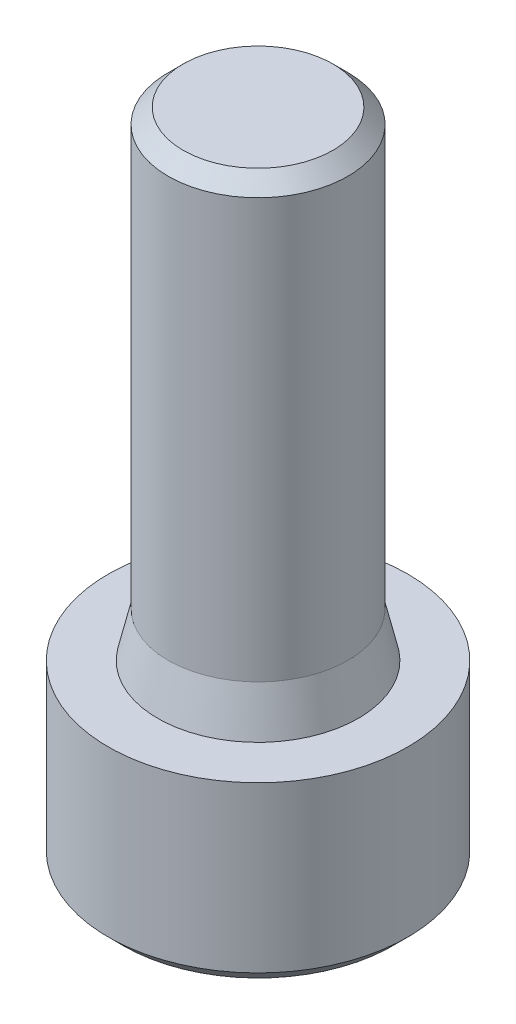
from build123d import *

# Parameters (mm, degrees)
SMUSSO1_SIZE             = 0.5
TAGLIO_ESTRUSIONE1_DEPTH = 4


with BuildPart() as part:
    # Schizzo1 → Rivoluzione1 (revolve)
    with BuildSketch(Plane(origin=(0, 0, 0), x_dir=(0, 0, -1), z_dir=(1, 0, 0))):
        Polygon((3, 7.5), (3.35, 6), (5, 6), (5, 0), (0, 0), (0, 22), (3, 22), align=None)
    revolve(axis=Axis((0, 0, 0), (0, 1, 0)))

    # Smusso1
    smusso1_edges = [part.edges().sort_by_distance(p)[0] for p in [
        (0, 0, 5),
        (0, 22, 3),
    ]]
    chamfer(smusso1_edges, length=SMUSSO1_SIZE)

    # Schizzo2 → Taglio-Estrusione1 (cut)
    with BuildSketch(Plane.XZ):
        Polygon((-1.443375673, 2.5), (-2.886751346, 0), (-1.443375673, -2.5), (1.443375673, -2.5), (2.886751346, 0), (1.443375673, 2.5), align=None)
    extrude(amount=-TAGLIO_ESTRUSIONE1_DEPTH, mode=Mode.SUBTRACT)

    # Schizzo3 → Taglia-Rivoluzione1 (revolve, cut)
    with BuildSketch(Plane(origin=(0, 0, 0), x_dir=(0, 0, -1), z_dir=(1, 0, 0))):
        Polygon((-1, 0), (-3, 0), (-1, 0.352653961), align=None)
    revolve(axis=Axis((0, 0, 0), (0, -1, 0)), mode=Mode.SUBTRACT)


solid = part.part
